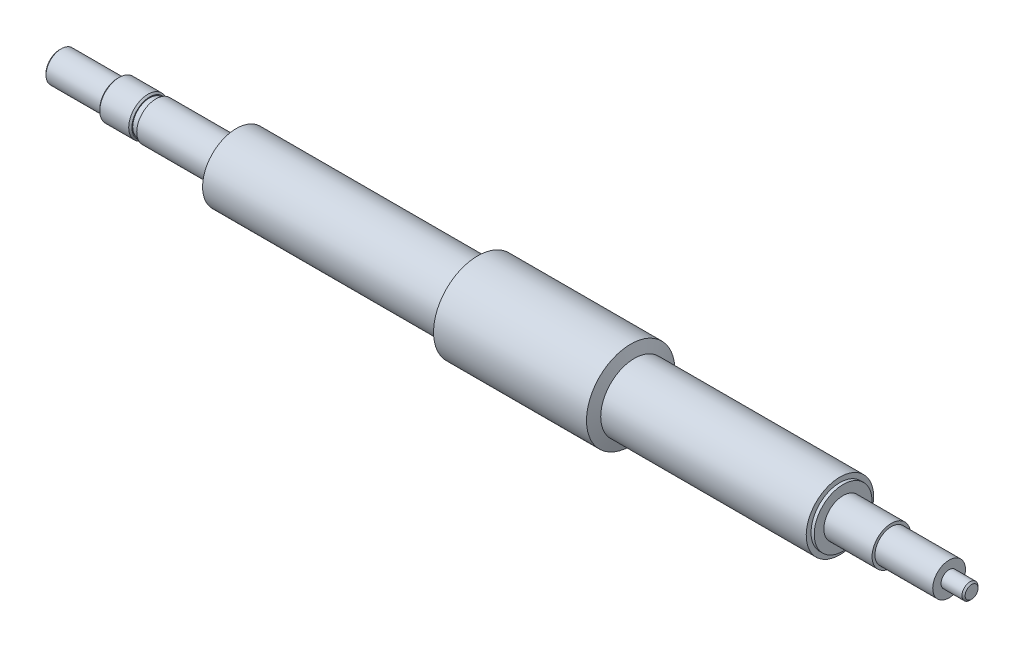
ISO-10303-21;
HEADER;
FILE_DESCRIPTION(('STEP AP214'),'2;1');
FILE_NAME('part.step','',(''),(''),'','','');
FILE_SCHEMA(('AUTOMOTIVE_DESIGN { 1 0 10303 214 1 1 1 1 }'));
ENDSEC;
DATA;
#1=APPLICATION_CONTEXT('core data for automotive mechanical design processes');
#2=APPLICATION_PROTOCOL_DEFINITION('international standard','automotive_design',2000,#1);
#3=PRODUCT_CONTEXT('',#1,'mechanical');
#4=PRODUCT('Part','Part','',(#3));
#5=PRODUCT_RELATED_PRODUCT_CATEGORY('part','',(#4));
#6=PRODUCT_DEFINITION_FORMATION('','',#4);
#7=PRODUCT_DEFINITION_CONTEXT('part definition',#1,'design');
#8=PRODUCT_DEFINITION('design','',#6,#7);
#9=PRODUCT_DEFINITION_SHAPE('','',#8);
#10=(LENGTH_UNIT() NAMED_UNIT(*) SI_UNIT(.MILLI.,.METRE.));
#11=(NAMED_UNIT(*) PLANE_ANGLE_UNIT() SI_UNIT($,.RADIAN.));
#12=(NAMED_UNIT(*) SI_UNIT($,.STERADIAN.) SOLID_ANGLE_UNIT());
#13=UNCERTAINTY_MEASURE_WITH_UNIT(LENGTH_MEASURE(1.E-05),#10,'distance_accuracy_value','');
#14=(GEOMETRIC_REPRESENTATION_CONTEXT(3) GLOBAL_UNCERTAINTY_ASSIGNED_CONTEXT((#13)) GLOBAL_UNIT_ASSIGNED_CONTEXT((#10,
#11,#12)) REPRESENTATION_CONTEXT('',''));
#15=CARTESIAN_POINT('',(0.,0.,0.));
#16=DIRECTION('',(0.,0.,1.));
#17=DIRECTION('',(1.,0.,0.));
#18=AXIS2_PLACEMENT_3D('',#15,#16,#17);
#19=CARTESIAN_POINT('',(130.,0.,0.));
#20=DIRECTION('',(-1.,0.,0.));
#21=DIRECTION('',(0.,-1.,0.));
#22=AXIS2_PLACEMENT_3D('',#19,#20,#21);
#23=PLANE('',#22);
#24=CARTESIAN_POINT('',(130.000000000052,0.,0.));
#25=DIRECTION('',(-1.,0.,0.));
#26=DIRECTION('',(0.,0.,1.));
#27=AXIS2_PLACEMENT_3D('',#24,#25,#26);
#28=CIRCLE('',#27,2.00000000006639);
#29=CARTESIAN_POINT('',(130.000000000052,0.,2.00000000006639));
#30=VERTEX_POINT('',#29);
#31=EDGE_CURVE('E17',#30,#30,#28,.T.);
#32=ORIENTED_EDGE('',*,*,#31,.F.);
#33=EDGE_LOOP('',(#32));
#34=FACE_BOUND('',#33,.T.);
#35=ADVANCED_FACE('F14',(#34),#23,.F.);
#36=CARTESIAN_POINT('',(-154.,0.,0.));
#37=DIRECTION('',(-1.,0.,0.));
#38=DIRECTION('',(0.,-1.,0.));
#39=AXIS2_PLACEMENT_3D('',#36,#37,#38);
#40=PLANE('',#39);
#41=CARTESIAN_POINT('',(-153.99999999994,0.,0.));
#42=DIRECTION('',(1.,0.,0.));
#43=DIRECTION('',(0.,0.,-1.));
#44=AXIS2_PLACEMENT_3D('',#41,#42,#43);
#45=CIRCLE('',#44,4.26000000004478);
#46=CARTESIAN_POINT('',(-153.99999999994,0.,-4.26000000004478));
#47=VERTEX_POINT('',#46);
#48=EDGE_CURVE('E87',#47,#47,#45,.T.);
#49=ORIENTED_EDGE('',*,*,#48,.F.);
#50=EDGE_LOOP('',(#49));
#51=FACE_BOUND('',#50,.T.);
#52=ADVANCED_FACE('F99',(#51),#40,.T.);
#53=CARTESIAN_POINT('',(129.500000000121,0.,0.));
#54=DIRECTION('',(-1.,0.,0.));
#55=DIRECTION('',(0.,0.,1.));
#56=AXIS2_PLACEMENT_3D('',#53,#54,#55);
#57=CONICAL_SURFACE('',#56,2.49999999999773,0.785398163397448);
#58=ORIENTED_EDGE('',*,*,#31,.T.);
#59=EDGE_LOOP('',(#58));
#60=FACE_BOUND('',#59,.T.);
#61=CARTESIAN_POINT('',(129.5,0.,0.));
#62=DIRECTION('',(-1.,0.,0.));
#63=DIRECTION('',(0.,-1.,0.));
#64=AXIS2_PLACEMENT_3D('',#61,#62,#63);
#65=CIRCLE('',#64,2.5);
#66=CARTESIAN_POINT('',(129.5,-2.5,0.));
#67=VERTEX_POINT('',#66);
#68=EDGE_CURVE('E30',#67,#67,#65,.T.);
#69=ORIENTED_EDGE('',*,*,#68,.F.);
#70=EDGE_LOOP('',(#69));
#71=FACE_BOUND('',#70,.T.);
#72=ADVANCED_FACE('F95',(#60,#71),#57,.T.);
#73=CARTESIAN_POINT('',(-153.500000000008,0.,0.));
#74=DIRECTION('',(1.,0.,0.));
#75=DIRECTION('',(0.,0.,-1.));
#76=AXIS2_PLACEMENT_3D('',#73,#74,#75);
#77=CONICAL_SURFACE('',#76,4.75999999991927,0.785398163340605);
#78=CARTESIAN_POINT('',(-153.5,0.,0.));
#79=DIRECTION('',(-1.,0.,0.));
#80=DIRECTION('',(0.,-1.,0.));
#81=AXIS2_PLACEMENT_3D('',#78,#79,#80);
#82=CIRCLE('',#81,4.76);
#83=CARTESIAN_POINT('',(-153.5,-4.76,0.));
#84=VERTEX_POINT('',#83);
#85=EDGE_CURVE('E86',#84,#84,#82,.F.);
#86=ORIENTED_EDGE('',*,*,#85,.F.);
#87=EDGE_LOOP('',(#86));
#88=FACE_BOUND('',#87,.T.);
#89=ORIENTED_EDGE('',*,*,#48,.T.);
#90=EDGE_LOOP('',(#89));
#91=FACE_BOUND('',#90,.T.);
#92=ADVANCED_FACE('F207',(#88,#91),#77,.T.);
#93=CARTESIAN_POINT('',(144.2,0.,0.));
#94=DIRECTION('',(-1.,0.,0.));
#95=DIRECTION('',(0.,-1.,0.));
#96=AXIS2_PLACEMENT_3D('',#93,#94,#95);
#97=CYLINDRICAL_SURFACE('',#96,2.5);
#98=ORIENTED_EDGE('',*,*,#68,.T.);
#99=EDGE_LOOP('',(#98));
#100=FACE_BOUND('',#99,.T.);
#101=CARTESIAN_POINT('',(123.,0.,0.));
#102=DIRECTION('',(-1.,0.,0.));
#103=DIRECTION('',(0.,-1.,0.));
#104=AXIS2_PLACEMENT_3D('',#101,#102,#103);
#105=CIRCLE('',#104,2.5);
#106=CARTESIAN_POINT('',(123.,-2.5,0.));
#107=VERTEX_POINT('',#106);
#108=EDGE_CURVE('E84',#107,#107,#105,.F.);
#109=ORIENTED_EDGE('',*,*,#108,.T.);
#110=EDGE_LOOP('',(#109));
#111=FACE_BOUND('',#110,.T.);
#112=ADVANCED_FACE('F203',(#100,#111),#97,.T.);
#113=CARTESIAN_POINT('',(144.2,0.,0.));
#114=DIRECTION('',(-1.,0.,0.));
#115=DIRECTION('',(0.,-1.,0.));
#116=AXIS2_PLACEMENT_3D('',#113,#114,#115);
#117=CYLINDRICAL_SURFACE('',#116,4.76);
#118=ORIENTED_EDGE('',*,*,#85,.T.);
#119=EDGE_LOOP('',(#118));
#120=FACE_BOUND('',#119,.T.);
#121=CARTESIAN_POINT('',(-136.,0.,0.));
#122=DIRECTION('',(-1.,0.,0.));
#123=DIRECTION('',(0.,-1.,0.));
#124=AXIS2_PLACEMENT_3D('',#121,#122,#123);
#125=CIRCLE('',#124,4.76);
#126=CARTESIAN_POINT('',(-136.,-4.76,0.));
#127=VERTEX_POINT('',#126);
#128=EDGE_CURVE('E81',#127,#127,#125,.F.);
#129=ORIENTED_EDGE('',*,*,#128,.F.);
#130=EDGE_LOOP('',(#129));
#131=FACE_BOUND('',#130,.T.);
#132=ADVANCED_FACE('F199',(#120,#131),#117,.T.);
#133=CARTESIAN_POINT('',(123.,0.,0.));
#134=DIRECTION('',(-1.,0.,0.));
#135=DIRECTION('',(0.,-1.,0.));
#136=AXIS2_PLACEMENT_3D('',#133,#134,#135);
#137=PLANE('',#136);
#138=CARTESIAN_POINT('',(123.,0.,0.));
#139=DIRECTION('',(-1.,0.,0.));
#140=DIRECTION('',(0.,-1.,0.));
#141=AXIS2_PLACEMENT_3D('',#138,#139,#140);
#142=CIRCLE('',#141,5.1);
#143=CARTESIAN_POINT('',(123.,-5.1,0.));
#144=VERTEX_POINT('',#143);
#145=EDGE_CURVE('E78',#144,#144,#142,.T.);
#146=ORIENTED_EDGE('',*,*,#145,.F.);
#147=EDGE_LOOP('',(#146));
#148=FACE_BOUND('',#147,.T.);
#149=ORIENTED_EDGE('',*,*,#108,.F.);
#150=EDGE_LOOP('',(#149));
#151=FACE_BOUND('',#150,.T.);
#152=ADVANCED_FACE('F195',(#148,#151),#137,.F.);
#153=CARTESIAN_POINT('',(-136.,0.,0.));
#154=DIRECTION('',(-1.,0.,0.));
#155=DIRECTION('',(0.,-1.,0.));
#156=AXIS2_PLACEMENT_3D('',#153,#154,#155);
#157=PLANE('',#156);
#158=CARTESIAN_POINT('',(-135.999999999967,0.,0.));
#159=DIRECTION('',(1.,0.,0.));
#160=DIRECTION('',(0.,0.,-1.));
#161=AXIS2_PLACEMENT_3D('',#158,#159,#160);
#162=CIRCLE('',#161,5.49999999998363);
#163=CARTESIAN_POINT('',(-135.999999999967,0.,-5.49999999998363));
#164=VERTEX_POINT('',#163);
#165=EDGE_CURVE('E75',#164,#164,#162,.T.);
#166=ORIENTED_EDGE('',*,*,#165,.F.);
#167=EDGE_LOOP('',(#166));
#168=FACE_BOUND('',#167,.T.);
#169=ORIENTED_EDGE('',*,*,#128,.T.);
#170=EDGE_LOOP('',(#169));
#171=FACE_BOUND('',#170,.T.);
#172=ADVANCED_FACE('F191',(#168,#171),#157,.T.);
#173=CARTESIAN_POINT('',(144.2,0.,0.));
#174=DIRECTION('',(-1.,0.,0.));
#175=DIRECTION('',(0.,-1.,0.));
#176=AXIS2_PLACEMENT_3D('',#173,#174,#175);
#177=CYLINDRICAL_SURFACE('',#176,5.1);
#178=ORIENTED_EDGE('',*,*,#145,.T.);
#179=EDGE_LOOP('',(#178));
#180=FACE_BOUND('',#179,.T.);
#181=CARTESIAN_POINT('',(105.,0.,0.));
#182=DIRECTION('',(-1.,0.,0.));
#183=DIRECTION('',(0.,-1.,0.));
#184=AXIS2_PLACEMENT_3D('',#181,#182,#183);
#185=CIRCLE('',#184,5.1);
#186=CARTESIAN_POINT('',(105.,-5.1,0.));
#187=VERTEX_POINT('',#186);
#188=EDGE_CURVE('E72',#187,#187,#185,.F.);
#189=ORIENTED_EDGE('',*,*,#188,.T.);
#190=EDGE_LOOP('',(#189));
#191=FACE_BOUND('',#190,.T.);
#192=ADVANCED_FACE('F187',(#180,#191),#177,.T.);
#193=CARTESIAN_POINT('',(-135.499999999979,0.,0.));
#194=DIRECTION('',(1.,0.,0.));
#195=DIRECTION('',(0.,0.,-1.));
#196=AXIS2_PLACEMENT_3D('',#193,#194,#195);
#197=CONICAL_SURFACE('',#196,6.00000000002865,0.785398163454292);
#198=CARTESIAN_POINT('',(-135.5,0.,0.));
#199=DIRECTION('',(-1.,0.,0.));
#200=DIRECTION('',(0.,-1.,0.));
#201=AXIS2_PLACEMENT_3D('',#198,#199,#200);
#202=CIRCLE('',#201,6.);
#203=CARTESIAN_POINT('',(-135.5,-6.,0.));
#204=VERTEX_POINT('',#203);
#205=EDGE_CURVE('E71',#204,#204,#202,.F.);
#206=ORIENTED_EDGE('',*,*,#205,.F.);
#207=EDGE_LOOP('',(#206));
#208=FACE_BOUND('',#207,.T.);
#209=ORIENTED_EDGE('',*,*,#165,.T.);
#210=EDGE_LOOP('',(#209));
#211=FACE_BOUND('',#210,.T.);
#212=ADVANCED_FACE('F183',(#208,#211),#197,.T.);
#213=CARTESIAN_POINT('',(105.,0.,0.));
#214=DIRECTION('',(-1.,0.,0.));
#215=DIRECTION('',(0.,-1.,0.));
#216=AXIS2_PLACEMENT_3D('',#213,#214,#215);
#217=PLANE('',#216);
#218=CARTESIAN_POINT('',(105.,0.,0.));
#219=DIRECTION('',(-1.,0.,0.));
#220=DIRECTION('',(0.,-1.,0.));
#221=AXIS2_PLACEMENT_3D('',#218,#219,#220);
#222=CIRCLE('',#221,6.);
#223=CARTESIAN_POINT('',(105.,-6.,0.));
#224=VERTEX_POINT('',#223);
#225=EDGE_CURVE('E68',#224,#224,#222,.T.);
#226=ORIENTED_EDGE('',*,*,#225,.F.);
#227=EDGE_LOOP('',(#226));
#228=FACE_BOUND('',#227,.T.);
#229=ORIENTED_EDGE('',*,*,#188,.F.);
#230=EDGE_LOOP('',(#229));
#231=FACE_BOUND('',#230,.T.);
#232=ADVANCED_FACE('F179',(#228,#231),#217,.F.);
#233=CARTESIAN_POINT('',(144.2,0.,0.));
#234=DIRECTION('',(-1.,0.,0.));
#235=DIRECTION('',(0.,-1.,0.));
#236=AXIS2_PLACEMENT_3D('',#233,#234,#235);
#237=CYLINDRICAL_SURFACE('',#236,6.);
#238=ORIENTED_EDGE('',*,*,#205,.T.);
#239=EDGE_LOOP('',(#238));
#240=FACE_BOUND('',#239,.T.);
#241=CARTESIAN_POINT('',(-126.500000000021,0.,0.));
#242=DIRECTION('',(-1.,0.,0.));
#243=DIRECTION('',(0.,0.,1.));
#244=AXIS2_PLACEMENT_3D('',#241,#242,#243);
#245=CIRCLE('',#244,5.99999999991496);
#246=CARTESIAN_POINT('',(-126.500000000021,0.,5.99999999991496));
#247=VERTEX_POINT('',#246);
#248=EDGE_CURVE('E67',#247,#247,#245,.F.);
#249=ORIENTED_EDGE('',*,*,#248,.F.);
#250=EDGE_LOOP('',(#249));
#251=FACE_BOUND('',#250,.T.);
#252=ADVANCED_FACE('F175',(#240,#251),#237,.T.);
#253=CARTESIAN_POINT('',(144.2,0.,0.));
#254=DIRECTION('',(-1.,0.,0.));
#255=DIRECTION('',(0.,-1.,0.));
#256=AXIS2_PLACEMENT_3D('',#253,#254,#255);
#257=CYLINDRICAL_SURFACE('',#256,6.);
#258=ORIENTED_EDGE('',*,*,#225,.T.);
#259=EDGE_LOOP('',(#258));
#260=FACE_BOUND('',#259,.T.);
#261=CARTESIAN_POINT('',(90.,0.,0.));
#262=DIRECTION('',(-1.,0.,0.));
#263=DIRECTION('',(0.,-1.,0.));
#264=AXIS2_PLACEMENT_3D('',#261,#262,#263);
#265=CIRCLE('',#264,6.);
#266=CARTESIAN_POINT('',(90.,-6.,0.));
#267=VERTEX_POINT('',#266);
#268=EDGE_CURVE('E64',#267,#267,#265,.F.);
#269=ORIENTED_EDGE('',*,*,#268,.T.);
#270=EDGE_LOOP('',(#269));
#271=FACE_BOUND('',#270,.T.);
#272=ADVANCED_FACE('F171',(#260,#271),#257,.T.);
#273=CARTESIAN_POINT('',(-126.500000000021,0.,0.));
#274=DIRECTION('',(-1.,0.,0.));
#275=DIRECTION('',(0.,0.,1.));
#276=AXIS2_PLACEMENT_3D('',#273,#274,#275);
#277=CONICAL_SURFACE('',#276,5.99999999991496,0.785398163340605);
#278=ORIENTED_EDGE('',*,*,#248,.T.);
#279=EDGE_LOOP('',(#278));
#280=FACE_BOUND('',#279,.T.);
#281=CARTESIAN_POINT('',(-125.999999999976,0.,0.));
#282=DIRECTION('',(-1.,0.,0.));
#283=DIRECTION('',(0.,0.,1.));
#284=AXIS2_PLACEMENT_3D('',#281,#282,#283);
#285=CIRCLE('',#284,5.49999999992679);
#286=CARTESIAN_POINT('',(-125.999999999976,0.,5.49999999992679));
#287=VERTEX_POINT('',#286);
#288=EDGE_CURVE('E61',#287,#287,#285,.T.);
#289=ORIENTED_EDGE('',*,*,#288,.T.);
#290=EDGE_LOOP('',(#289));
#291=FACE_BOUND('',#290,.T.);
#292=ADVANCED_FACE('F167',(#280,#291),#277,.T.);
#293=CARTESIAN_POINT('',(90.,0.,0.));
#294=DIRECTION('',(-1.,0.,0.));
#295=DIRECTION('',(0.,-1.,0.));
#296=AXIS2_PLACEMENT_3D('',#293,#294,#295);
#297=PLANE('',#296);
#298=CARTESIAN_POINT('',(90.,0.,0.));
#299=DIRECTION('',(-1.,0.,0.));
#300=DIRECTION('',(0.,-1.,0.));
#301=AXIS2_PLACEMENT_3D('',#298,#299,#300);
#302=CIRCLE('',#301,9.);
#303=CARTESIAN_POINT('',(90.,-9.,0.));
#304=VERTEX_POINT('',#303);
#305=EDGE_CURVE('E58',#304,#304,#302,.T.);
#306=ORIENTED_EDGE('',*,*,#305,.F.);
#307=EDGE_LOOP('',(#306));
#308=FACE_BOUND('',#307,.T.);
#309=ORIENTED_EDGE('',*,*,#268,.F.);
#310=EDGE_LOOP('',(#309));
#311=FACE_BOUND('',#310,.T.);
#312=ADVANCED_FACE('F163',(#308,#311),#297,.F.);
#313=CARTESIAN_POINT('',(-126.,0.,0.));
#314=DIRECTION('',(-1.,0.,0.));
#315=DIRECTION('',(0.,-1.,0.));
#316=AXIS2_PLACEMENT_3D('',#313,#314,#315);
#317=PLANE('',#316);
#318=ORIENTED_EDGE('',*,*,#288,.F.);
#319=EDGE_LOOP('',(#318));
#320=FACE_BOUND('',#319,.T.);
#321=CARTESIAN_POINT('',(-126.,0.,0.));
#322=DIRECTION('',(-1.,0.,0.));
#323=DIRECTION('',(0.,-1.,0.));
#324=AXIS2_PLACEMENT_3D('',#321,#322,#323);
#325=CIRCLE('',#324,5.25);
#326=CARTESIAN_POINT('',(-126.,-5.25,0.));
#327=VERTEX_POINT('',#326);
#328=EDGE_CURVE('E55',#327,#327,#325,.F.);
#329=ORIENTED_EDGE('',*,*,#328,.F.);
#330=EDGE_LOOP('',(#329));
#331=FACE_BOUND('',#330,.T.);
#332=ADVANCED_FACE('F159',(#320,#331),#317,.F.);
#333=CARTESIAN_POINT('',(144.2,0.,0.));
#334=DIRECTION('',(-1.,0.,0.));
#335=DIRECTION('',(0.,-1.,0.));
#336=AXIS2_PLACEMENT_3D('',#333,#334,#335);
#337=CYLINDRICAL_SURFACE('',#336,9.);
#338=ORIENTED_EDGE('',*,*,#305,.T.);
#339=EDGE_LOOP('',(#338));
#340=FACE_BOUND('',#339,.T.);
#341=CARTESIAN_POINT('',(89.,0.,0.));
#342=DIRECTION('',(-1.,0.,0.));
#343=DIRECTION('',(0.,-1.,0.));
#344=AXIS2_PLACEMENT_3D('',#341,#342,#343);
#345=CIRCLE('',#344,9.);
#346=CARTESIAN_POINT('',(89.,-9.,0.));
#347=VERTEX_POINT('',#346);
#348=EDGE_CURVE('E52',#347,#347,#345,.F.);
#349=ORIENTED_EDGE('',*,*,#348,.T.);
#350=EDGE_LOOP('',(#349));
#351=FACE_BOUND('',#350,.T.);
#352=ADVANCED_FACE('F155',(#340,#351),#337,.T.);
#353=CARTESIAN_POINT('',(144.2,0.,0.));
#354=DIRECTION('',(-1.,0.,0.));
#355=DIRECTION('',(0.,-1.,0.));
#356=AXIS2_PLACEMENT_3D('',#353,#354,#355);
#357=CYLINDRICAL_SURFACE('',#356,5.25);
#358=ORIENTED_EDGE('',*,*,#328,.T.);
#359=EDGE_LOOP('',(#358));
#360=FACE_BOUND('',#359,.T.);
#361=CARTESIAN_POINT('',(-124.,0.,0.));
#362=DIRECTION('',(-1.,0.,0.));
#363=DIRECTION('',(0.,-1.,0.));
#364=AXIS2_PLACEMENT_3D('',#361,#362,#363);
#365=CIRCLE('',#364,5.25);
#366=CARTESIAN_POINT('',(-124.,-5.25,0.));
#367=VERTEX_POINT('',#366);
#368=EDGE_CURVE('E49',#367,#367,#365,.F.);
#369=ORIENTED_EDGE('',*,*,#368,.F.);
#370=EDGE_LOOP('',(#369));
#371=FACE_BOUND('',#370,.T.);
#372=ADVANCED_FACE('F151',(#360,#371),#357,.T.);
#373=CARTESIAN_POINT('',(89.,0.,0.));
#374=DIRECTION('',(-1.,0.,0.));
#375=DIRECTION('',(0.,-1.,0.));
#376=AXIS2_PLACEMENT_3D('',#373,#374,#375);
#377=PLANE('',#376);
#378=CARTESIAN_POINT('',(89.,0.,0.));
#379=DIRECTION('',(-1.,0.,0.));
#380=DIRECTION('',(0.,-1.,0.));
#381=AXIS2_PLACEMENT_3D('',#378,#379,#380);
#382=CIRCLE('',#381,10.5);
#383=CARTESIAN_POINT('',(89.,-10.5,0.));
#384=VERTEX_POINT('',#383);
#385=EDGE_CURVE('E46',#384,#384,#382,.T.);
#386=ORIENTED_EDGE('',*,*,#385,.F.);
#387=EDGE_LOOP('',(#386));
#388=FACE_BOUND('',#387,.T.);
#389=ORIENTED_EDGE('',*,*,#348,.F.);
#390=EDGE_LOOP('',(#389));
#391=FACE_BOUND('',#390,.T.);
#392=ADVANCED_FACE('F147',(#388,#391),#377,.F.);
#393=CARTESIAN_POINT('',(-124.,0.,0.));
#394=DIRECTION('',(-1.,0.,0.));
#395=DIRECTION('',(0.,-1.,0.));
#396=AXIS2_PLACEMENT_3D('',#393,#394,#395);
#397=PLANE('',#396);
#398=CARTESIAN_POINT('',(-124.,0.,0.));
#399=DIRECTION('',(-1.,0.,0.));
#400=DIRECTION('',(0.,-1.,0.));
#401=AXIS2_PLACEMENT_3D('',#398,#399,#400);
#402=CIRCLE('',#401,6.);
#403=CARTESIAN_POINT('',(-124.,-6.,0.));
#404=VERTEX_POINT('',#403);
#405=EDGE_CURVE('E43',#404,#404,#402,.F.);
#406=ORIENTED_EDGE('',*,*,#405,.F.);
#407=EDGE_LOOP('',(#406));
#408=FACE_BOUND('',#407,.T.);
#409=ORIENTED_EDGE('',*,*,#368,.T.);
#410=EDGE_LOOP('',(#409));
#411=FACE_BOUND('',#410,.T.);
#412=ADVANCED_FACE('F143',(#408,#411),#397,.T.);
#413=CARTESIAN_POINT('',(144.2,0.,0.));
#414=DIRECTION('',(-1.,0.,0.));
#415=DIRECTION('',(0.,-1.,0.));
#416=AXIS2_PLACEMENT_3D('',#413,#414,#415);
#417=CYLINDRICAL_SURFACE('',#416,10.5);
#418=ORIENTED_EDGE('',*,*,#385,.T.);
#419=EDGE_LOOP('',(#418));
#420=FACE_BOUND('',#419,.T.);
#421=CARTESIAN_POINT('',(25.0000000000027,0.,0.));
#422=DIRECTION('',(-1.,0.,0.));
#423=DIRECTION('',(0.,0.,1.));
#424=AXIS2_PLACEMENT_3D('',#421,#422,#423);
#425=CIRCLE('',#424,10.500000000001);
#426=CARTESIAN_POINT('',(25.0000000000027,0.,10.500000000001));
#427=VERTEX_POINT('',#426);
#428=EDGE_CURVE('E42',#427,#427,#425,.T.);
#429=ORIENTED_EDGE('',*,*,#428,.F.);
#430=EDGE_LOOP('',(#429));
#431=FACE_BOUND('',#430,.T.);
#432=ADVANCED_FACE('F139',(#420,#431),#417,.T.);
#433=CARTESIAN_POINT('',(144.2,0.,0.));
#434=DIRECTION('',(-1.,0.,0.));
#435=DIRECTION('',(0.,-1.,0.));
#436=AXIS2_PLACEMENT_3D('',#433,#434,#435);
#437=CYLINDRICAL_SURFACE('',#436,6.);
#438=ORIENTED_EDGE('',*,*,#405,.T.);
#439=EDGE_LOOP('',(#438));
#440=FACE_BOUND('',#439,.T.);
#441=CARTESIAN_POINT('',(-100.,0.,0.));
#442=DIRECTION('',(-1.,0.,0.));
#443=DIRECTION('',(0.,-1.,0.));
#444=AXIS2_PLACEMENT_3D('',#441,#442,#443);
#445=CIRCLE('',#444,6.);
#446=CARTESIAN_POINT('',(-100.,-6.,0.));
#447=VERTEX_POINT('',#446);
#448=EDGE_CURVE('E39',#447,#447,#445,.F.);
#449=ORIENTED_EDGE('',*,*,#448,.F.);
#450=EDGE_LOOP('',(#449));
#451=FACE_BOUND('',#450,.T.);
#452=ADVANCED_FACE('F135',(#440,#451),#437,.T.);
#453=CARTESIAN_POINT('',(23.81709673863,0.,0.));
#454=DIRECTION('',(-1.,0.,0.));
#455=DIRECTION('',(0.,0.,1.));
#456=AXIS2_PLACEMENT_3D('',#453,#454,#455);
#457=CONICAL_SURFACE('',#456,13.7500000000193,1.2217304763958);
#458=ORIENTED_EDGE('',*,*,#428,.T.);
#459=EDGE_LOOP('',(#458));
#460=FACE_BOUND('',#459,.T.);
#461=CARTESIAN_POINT('',(23.81709673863,0.,0.));
#462=DIRECTION('',(-1.,0.,0.));
#463=DIRECTION('',(0.,-1.,0.));
#464=AXIS2_PLACEMENT_3D('',#461,#462,#463);
#465=CIRCLE('',#464,13.75);
#466=CARTESIAN_POINT('',(23.81709673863,-13.75,0.));
#467=VERTEX_POINT('',#466);
#468=EDGE_CURVE('E38',#467,#467,#465,.T.);
#469=ORIENTED_EDGE('',*,*,#468,.F.);
#470=EDGE_LOOP('',(#469));
#471=FACE_BOUND('',#470,.T.);
#472=ADVANCED_FACE('F131',(#460,#471),#457,.T.);
#473=CARTESIAN_POINT('',(-100.,0.,0.));
#474=DIRECTION('',(-1.,0.,0.));
#475=DIRECTION('',(0.,-1.,0.));
#476=AXIS2_PLACEMENT_3D('',#473,#474,#475);
#477=PLANE('',#476);
#478=CARTESIAN_POINT('',(-100.,0.,0.));
#479=DIRECTION('',(-1.,0.,0.));
#480=DIRECTION('',(0.,-1.,0.));
#481=AXIS2_PLACEMENT_3D('',#478,#479,#480);
#482=CIRCLE('',#481,9.);
#483=CARTESIAN_POINT('',(-100.,-9.,0.));
#484=VERTEX_POINT('',#483);
#485=EDGE_CURVE('E35',#484,#484,#482,.F.);
#486=ORIENTED_EDGE('',*,*,#485,.F.);
#487=EDGE_LOOP('',(#486));
#488=FACE_BOUND('',#487,.T.);
#489=ORIENTED_EDGE('',*,*,#448,.T.);
#490=EDGE_LOOP('',(#489));
#491=FACE_BOUND('',#490,.T.);
#492=ADVANCED_FACE('F127',(#488,#491),#477,.T.);
#493=CARTESIAN_POINT('',(144.2,0.,0.));
#494=DIRECTION('',(-1.,0.,0.));
#495=DIRECTION('',(0.,-1.,0.));
#496=AXIS2_PLACEMENT_3D('',#493,#494,#495);
#497=CYLINDRICAL_SURFACE('',#496,13.75);
#498=ORIENTED_EDGE('',*,*,#468,.T.);
#499=EDGE_LOOP('',(#498));
#500=FACE_BOUND('',#499,.T.);
#501=CARTESIAN_POINT('',(-23.8170967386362,0.,0.));
#502=DIRECTION('',(1.,0.,0.));
#503=DIRECTION('',(0.,0.,-1.));
#504=AXIS2_PLACEMENT_3D('',#501,#502,#503);
#505=CIRCLE('',#504,13.7500000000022);
#506=CARTESIAN_POINT('',(-23.8170967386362,0.,-13.7500000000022));
#507=VERTEX_POINT('',#506);
#508=EDGE_CURVE('E34',#507,#507,#505,.F.);
#509=ORIENTED_EDGE('',*,*,#508,.F.);
#510=EDGE_LOOP('',(#509));
#511=FACE_BOUND('',#510,.T.);
#512=ADVANCED_FACE('F123',(#500,#511),#497,.T.);
#513=CARTESIAN_POINT('',(144.2,0.,0.));
#514=DIRECTION('',(-1.,0.,0.));
#515=DIRECTION('',(0.,-1.,0.));
#516=AXIS2_PLACEMENT_3D('',#513,#514,#515);
#517=CYLINDRICAL_SURFACE('',#516,9.);
#518=ORIENTED_EDGE('',*,*,#485,.T.);
#519=EDGE_LOOP('',(#518));
#520=FACE_BOUND('',#519,.T.);
#521=CARTESIAN_POINT('',(-99.,0.,0.));
#522=DIRECTION('',(-1.,0.,0.));
#523=DIRECTION('',(0.,-1.,0.));
#524=AXIS2_PLACEMENT_3D('',#521,#522,#523);
#525=CIRCLE('',#524,9.);
#526=CARTESIAN_POINT('',(-99.,-9.,0.));
#527=VERTEX_POINT('',#526);
#528=EDGE_CURVE('E26',#527,#527,#525,.F.);
#529=ORIENTED_EDGE('',*,*,#528,.F.);
#530=EDGE_LOOP('',(#529));
#531=FACE_BOUND('',#530,.T.);
#532=ADVANCED_FACE('F119',(#520,#531),#517,.T.);
#533=CARTESIAN_POINT('',(-23.8170967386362,0.,0.));
#534=DIRECTION('',(1.,0.,0.));
#535=DIRECTION('',(0.,0.,-1.));
#536=AXIS2_PLACEMENT_3D('',#533,#534,#535);
#537=CONICAL_SURFACE('',#536,13.7500000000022,1.2217304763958);
#538=CARTESIAN_POINT('',(-25.,0.,0.));
#539=DIRECTION('',(-1.,0.,0.));
#540=DIRECTION('',(0.,-1.,0.));
#541=AXIS2_PLACEMENT_3D('',#538,#539,#540);
#542=CIRCLE('',#541,10.5);
#543=CARTESIAN_POINT('',(-25.,-10.5,0.));
#544=VERTEX_POINT('',#543);
#545=EDGE_CURVE('E21',#544,#544,#542,.T.);
#546=ORIENTED_EDGE('',*,*,#545,.F.);
#547=EDGE_LOOP('',(#546));
#548=FACE_BOUND('',#547,.T.);
#549=ORIENTED_EDGE('',*,*,#508,.T.);
#550=EDGE_LOOP('',(#549));
#551=FACE_BOUND('',#550,.T.);
#552=ADVANCED_FACE('F113',(#548,#551),#537,.T.);
#553=CARTESIAN_POINT('',(-99.,0.,0.));
#554=DIRECTION('',(-1.,0.,0.));
#555=DIRECTION('',(0.,-1.,0.));
#556=AXIS2_PLACEMENT_3D('',#553,#554,#555);
#557=PLANE('',#556);
#558=CARTESIAN_POINT('',(-99.,0.,0.));
#559=DIRECTION('',(-1.,0.,0.));
#560=DIRECTION('',(0.,-1.,0.));
#561=AXIS2_PLACEMENT_3D('',#558,#559,#560);
#562=CIRCLE('',#561,10.5);
#563=CARTESIAN_POINT('',(-99.,-10.5,0.));
#564=VERTEX_POINT('',#563);
#565=EDGE_CURVE('E10',#564,#564,#562,.F.);
#566=ORIENTED_EDGE('',*,*,#565,.F.);
#567=EDGE_LOOP('',(#566));
#568=FACE_BOUND('',#567,.T.);
#569=ORIENTED_EDGE('',*,*,#528,.T.);
#570=EDGE_LOOP('',(#569));
#571=FACE_BOUND('',#570,.T.);
#572=ADVANCED_FACE('F107',(#568,#571),#557,.T.);
#573=CARTESIAN_POINT('',(144.2,0.,0.));
#574=DIRECTION('',(-1.,0.,0.));
#575=DIRECTION('',(0.,-1.,0.));
#576=AXIS2_PLACEMENT_3D('',#573,#574,#575);
#577=CYLINDRICAL_SURFACE('',#576,10.5);
#578=ORIENTED_EDGE('',*,*,#545,.T.);
#579=EDGE_LOOP('',(#578));
#580=FACE_BOUND('',#579,.T.);
#581=ORIENTED_EDGE('',*,*,#565,.T.);
#582=EDGE_LOOP('',(#581));
#583=FACE_BOUND('',#582,.T.);
#584=ADVANCED_FACE('F105',(#580,#583),#577,.T.);
#585=CLOSED_SHELL('',(#35,#52,#72,#92,#112,#132,#152,#172,#192,#212,#232,#252,#272,#292,#312,
#332,#352,#372,#392,#412,#432,#452,#472,#492,#512,#532,#552,#572,#584));
#586=MANIFOLD_SOLID_BREP('B1',#585);
#587=ADVANCED_BREP_SHAPE_REPRESENTATION('',(#18,#586),#14);
#588=SHAPE_DEFINITION_REPRESENTATION(#9,#587);
ENDSEC;
END-ISO-10303-21;
